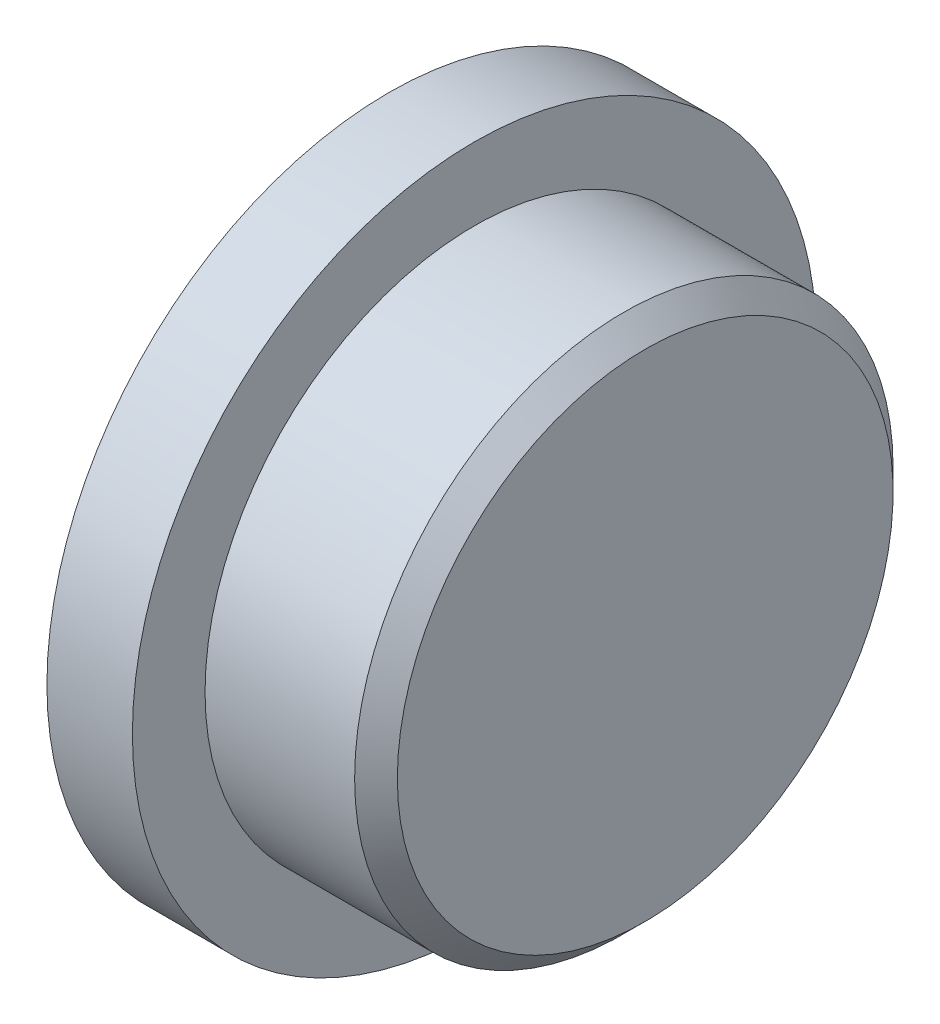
ISO-10303-21;
HEADER;
FILE_DESCRIPTION(('STEP AP214'),'2;1');
FILE_NAME('part.step','',(''),(''),'','','');
FILE_SCHEMA(('AUTOMOTIVE_DESIGN { 1 0 10303 214 1 1 1 1 }'));
ENDSEC;
DATA;
#1=APPLICATION_CONTEXT('core data for automotive mechanical design processes');
#2=APPLICATION_PROTOCOL_DEFINITION('international standard','automotive_design',2000,#1);
#3=PRODUCT_CONTEXT('',#1,'mechanical');
#4=PRODUCT('Part','Part','',(#3));
#5=PRODUCT_RELATED_PRODUCT_CATEGORY('part','',(#4));
#6=PRODUCT_DEFINITION_FORMATION('','',#4);
#7=PRODUCT_DEFINITION_CONTEXT('part definition',#1,'design');
#8=PRODUCT_DEFINITION('design','',#6,#7);
#9=PRODUCT_DEFINITION_SHAPE('','',#8);
#10=(LENGTH_UNIT() NAMED_UNIT(*) SI_UNIT(.MILLI.,.METRE.));
#11=(NAMED_UNIT(*) PLANE_ANGLE_UNIT() SI_UNIT($,.RADIAN.));
#12=(NAMED_UNIT(*) SI_UNIT($,.STERADIAN.) SOLID_ANGLE_UNIT());
#13=UNCERTAINTY_MEASURE_WITH_UNIT(LENGTH_MEASURE(1.E-05),#10,'distance_accuracy_value','');
#14=(GEOMETRIC_REPRESENTATION_CONTEXT(3) GLOBAL_UNCERTAINTY_ASSIGNED_CONTEXT((#13)) GLOBAL_UNIT_ASSIGNED_CONTEXT((#10,
#11,#12)) REPRESENTATION_CONTEXT('',''));
#15=CARTESIAN_POINT('',(0.,0.,0.));
#16=DIRECTION('',(0.,0.,1.));
#17=DIRECTION('',(1.,0.,0.));
#18=AXIS2_PLACEMENT_3D('',#15,#16,#17);
#19=CARTESIAN_POINT('',(0.,4.,0.));
#20=DIRECTION('',(1.,0.,0.));
#21=DIRECTION('',(0.,0.,-1.));
#22=AXIS2_PLACEMENT_3D('',#19,#20,#21);
#23=PLANE('',#22);
#24=CARTESIAN_POINT('',(0.,0.,0.));
#25=DIRECTION('',(-1.,0.,0.));
#26=DIRECTION('',(0.,0.,1.));
#27=AXIS2_PLACEMENT_3D('',#24,#25,#26);
#28=CIRCLE('',#27,4.);
#29=CARTESIAN_POINT('',(0.,0.,4.));
#30=VERTEX_POINT('',#29);
#31=EDGE_CURVE('E61',#30,#30,#28,.T.);
#32=ORIENTED_EDGE('',*,*,#31,.T.);
#33=EDGE_LOOP('',(#32));
#34=FACE_BOUND('',#33,.T.);
#35=ADVANCED_FACE('F37',(#34),#23,.F.);
#36=CARTESIAN_POINT('',(3.,0.,0.));
#37=DIRECTION('',(-1.,0.,0.));
#38=DIRECTION('',(0.,0.,1.));
#39=AXIS2_PLACEMENT_3D('',#36,#37,#38);
#40=PLANE('',#39);
#41=CARTESIAN_POINT('',(3.,0.,0.));
#42=DIRECTION('',(-1.,0.,0.));
#43=DIRECTION('',(0.,0.,1.));
#44=AXIS2_PLACEMENT_3D('',#41,#42,#43);
#45=CIRCLE('',#44,2.9);
#46=CARTESIAN_POINT('',(3.,0.,2.9));
#47=VERTEX_POINT('',#46);
#48=EDGE_CURVE('E10',#47,#47,#45,.F.);
#49=ORIENTED_EDGE('',*,*,#48,.T.);
#50=EDGE_LOOP('',(#49));
#51=FACE_BOUND('',#50,.T.);
#52=ADVANCED_FACE('F81',(#51),#40,.F.);
#53=CARTESIAN_POINT('',(0.,0.,0.));
#54=DIRECTION('',(-1.,0.,0.));
#55=DIRECTION('',(0.,0.,1.));
#56=AXIS2_PLACEMENT_3D('',#53,#54,#55);
#57=CYLINDRICAL_SURFACE('',#56,3.15);
#58=CARTESIAN_POINT('',(2.75,0.,0.));
#59=DIRECTION('',(-1.,0.,0.));
#60=DIRECTION('',(0.,0.,1.));
#61=AXIS2_PLACEMENT_3D('',#58,#59,#60);
#62=CIRCLE('',#61,3.15);
#63=CARTESIAN_POINT('',(2.75,0.,3.15));
#64=VERTEX_POINT('',#63);
#65=EDGE_CURVE('E45',#64,#64,#62,.T.);
#66=ORIENTED_EDGE('',*,*,#65,.T.);
#67=EDGE_LOOP('',(#66));
#68=FACE_BOUND('',#67,.T.);
#69=CARTESIAN_POINT('',(1.,0.,0.));
#70=DIRECTION('',(-1.,0.,0.));
#71=DIRECTION('',(0.,0.,1.));
#72=AXIS2_PLACEMENT_3D('',#69,#70,#71);
#73=CIRCLE('',#72,3.15);
#74=CARTESIAN_POINT('',(1.,0.,3.15));
#75=VERTEX_POINT('',#74);
#76=EDGE_CURVE('E50',#75,#75,#73,.T.);
#77=ORIENTED_EDGE('',*,*,#76,.F.);
#78=EDGE_LOOP('',(#77));
#79=FACE_BOUND('',#78,.T.);
#80=ADVANCED_FACE('F76',(#68,#79),#57,.T.);
#81=CARTESIAN_POINT('',(1.,3.15,0.));
#82=DIRECTION('',(-1.,0.,0.));
#83=DIRECTION('',(0.,0.,1.));
#84=AXIS2_PLACEMENT_3D('',#81,#82,#83);
#85=PLANE('',#84);
#86=CARTESIAN_POINT('',(1.,0.,0.));
#87=DIRECTION('',(-1.,0.,0.));
#88=DIRECTION('',(0.,0.,1.));
#89=AXIS2_PLACEMENT_3D('',#86,#87,#88);
#90=CIRCLE('',#89,4.);
#91=CARTESIAN_POINT('',(1.,0.,4.));
#92=VERTEX_POINT('',#91);
#93=EDGE_CURVE('E55',#92,#92,#90,.T.);
#94=ORIENTED_EDGE('',*,*,#93,.F.);
#95=EDGE_LOOP('',(#94));
#96=FACE_BOUND('',#95,.T.);
#97=ORIENTED_EDGE('',*,*,#76,.T.);
#98=EDGE_LOOP('',(#97));
#99=FACE_BOUND('',#98,.T.);
#100=ADVANCED_FACE('F70',(#96,#99),#85,.F.);
#101=CARTESIAN_POINT('',(0.,0.,0.));
#102=DIRECTION('',(-1.,0.,0.));
#103=DIRECTION('',(0.,0.,1.));
#104=AXIS2_PLACEMENT_3D('',#101,#102,#103);
#105=CYLINDRICAL_SURFACE('',#104,4.);
#106=ORIENTED_EDGE('',*,*,#31,.F.);
#107=EDGE_LOOP('',(#106));
#108=FACE_BOUND('',#107,.T.);
#109=ORIENTED_EDGE('',*,*,#93,.T.);
#110=EDGE_LOOP('',(#109));
#111=FACE_BOUND('',#110,.T.);
#112=ADVANCED_FACE('F67',(#108,#111),#105,.T.);
#113=CARTESIAN_POINT('',(2.75,0.,0.));
#114=DIRECTION('',(-1.,0.,0.));
#115=DIRECTION('',(0.,0.,1.));
#116=AXIS2_PLACEMENT_3D('',#113,#114,#115);
#117=CONICAL_SURFACE('',#116,3.15,0.785398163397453);
#118=ORIENTED_EDGE('',*,*,#48,.F.);
#119=EDGE_LOOP('',(#118));
#120=FACE_BOUND('',#119,.T.);
#121=ORIENTED_EDGE('',*,*,#65,.F.);
#122=EDGE_LOOP('',(#121));
#123=FACE_BOUND('',#122,.T.);
#124=ADVANCED_FACE('F39',(#120,#123),#117,.T.);
#125=CLOSED_SHELL('',(#35,#52,#80,#100,#112,#124));
#126=MANIFOLD_SOLID_BREP('B2',#125);
#127=ADVANCED_BREP_SHAPE_REPRESENTATION('',(#18,#126),#14);
#128=SHAPE_DEFINITION_REPRESENTATION(#9,#127);
ENDSEC;
END-ISO-10303-21;
